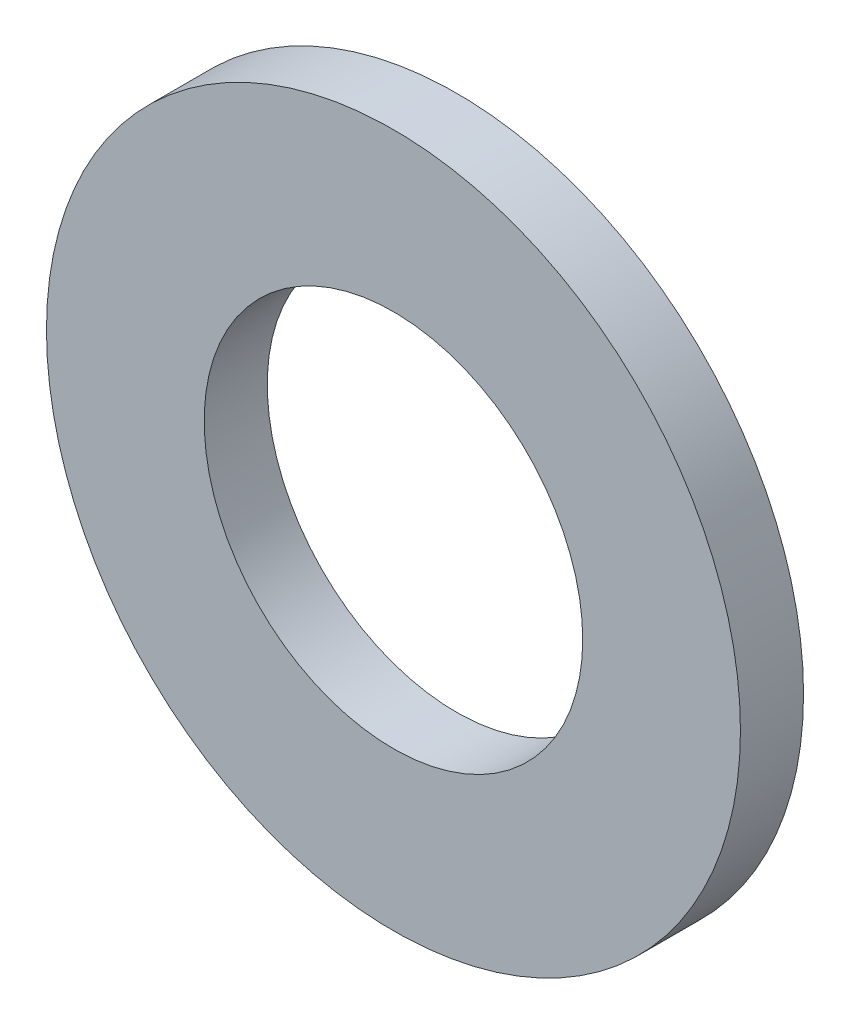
ISO-10303-21;
HEADER;
FILE_DESCRIPTION(('STEP AP214'),'2;1');
FILE_NAME('part.step','',(''),(''),'','','');
FILE_SCHEMA(('AUTOMOTIVE_DESIGN { 1 0 10303 214 1 1 1 1 }'));
ENDSEC;
DATA;
#1=APPLICATION_CONTEXT('core data for automotive mechanical design processes');
#2=APPLICATION_PROTOCOL_DEFINITION('international standard','automotive_design',2000,#1);
#3=PRODUCT_CONTEXT('',#1,'mechanical');
#4=PRODUCT('Part','Part','',(#3));
#5=PRODUCT_RELATED_PRODUCT_CATEGORY('part','',(#4));
#6=PRODUCT_DEFINITION_FORMATION('','',#4);
#7=PRODUCT_DEFINITION_CONTEXT('part definition',#1,'design');
#8=PRODUCT_DEFINITION('design','',#6,#7);
#9=PRODUCT_DEFINITION_SHAPE('','',#8);
#10=(LENGTH_UNIT() NAMED_UNIT(*) SI_UNIT(.MILLI.,.METRE.));
#11=(NAMED_UNIT(*) PLANE_ANGLE_UNIT() SI_UNIT($,.RADIAN.));
#12=(NAMED_UNIT(*) SI_UNIT($,.STERADIAN.) SOLID_ANGLE_UNIT());
#13=UNCERTAINTY_MEASURE_WITH_UNIT(LENGTH_MEASURE(1.E-05),#10,'distance_accuracy_value','');
#14=(GEOMETRIC_REPRESENTATION_CONTEXT(3) GLOBAL_UNCERTAINTY_ASSIGNED_CONTEXT((#13)) GLOBAL_UNIT_ASSIGNED_CONTEXT((#10,
#11,#12)) REPRESENTATION_CONTEXT('',''));
#15=CARTESIAN_POINT('',(0.,0.,0.));
#16=DIRECTION('',(0.,0.,1.));
#17=DIRECTION('',(1.,0.,0.));
#18=AXIS2_PLACEMENT_3D('',#15,#16,#17);
#19=CARTESIAN_POINT('',(0.,0.,1.5875));
#20=DIRECTION('',(0.,0.,1.));
#21=DIRECTION('',(1.,0.,0.));
#22=AXIS2_PLACEMENT_3D('',#19,#20,#21);
#23=PLANE('',#22);
#24=CARTESIAN_POINT('',(0.,0.,1.5875));
#25=DIRECTION('',(0.,0.,1.));
#26=DIRECTION('',(1.,0.,0.));
#27=AXIS2_PLACEMENT_3D('',#24,#25,#26);
#28=CIRCLE('',#27,8.73125);
#29=CARTESIAN_POINT('',(8.73125,0.,1.5875));
#30=VERTEX_POINT('',#29);
#31=EDGE_CURVE('E10',#30,#30,#28,.T.);
#32=ORIENTED_EDGE('',*,*,#31,.T.);
#33=EDGE_LOOP('',(#32));
#34=FACE_BOUND('',#33,.T.);
#35=CARTESIAN_POINT('',(0.,0.,1.5875));
#36=DIRECTION('',(0.,0.,1.));
#37=DIRECTION('',(1.,0.,0.));
#38=AXIS2_PLACEMENT_3D('',#35,#36,#37);
#39=CIRCLE('',#38,4.7625);
#40=CARTESIAN_POINT('',(4.7625,0.,1.5875));
#41=VERTEX_POINT('',#40);
#42=EDGE_CURVE('E54',#41,#41,#39,.T.);
#43=ORIENTED_EDGE('',*,*,#42,.F.);
#44=EDGE_LOOP('',(#43));
#45=FACE_BOUND('',#44,.T.);
#46=ADVANCED_FACE('F41',(#34,#45),#23,.T.);
#47=CARTESIAN_POINT('',(0.,0.,0.));
#48=DIRECTION('',(0.,0.,1.));
#49=DIRECTION('',(1.,0.,0.));
#50=AXIS2_PLACEMENT_3D('',#47,#48,#49);
#51=PLANE('',#50);
#52=CARTESIAN_POINT('',(0.,0.,0.));
#53=DIRECTION('',(0.,0.,1.));
#54=DIRECTION('',(1.,0.,0.));
#55=AXIS2_PLACEMENT_3D('',#52,#53,#54);
#56=CIRCLE('',#55,8.73125);
#57=CARTESIAN_POINT('',(8.73125,0.,0.));
#58=VERTEX_POINT('',#57);
#59=EDGE_CURVE('E45',#58,#58,#56,.T.);
#60=ORIENTED_EDGE('',*,*,#59,.F.);
#61=EDGE_LOOP('',(#60));
#62=FACE_BOUND('',#61,.T.);
#63=CARTESIAN_POINT('',(0.,0.,0.));
#64=DIRECTION('',(0.,0.,1.));
#65=DIRECTION('',(1.,0.,0.));
#66=AXIS2_PLACEMENT_3D('',#63,#64,#65);
#67=CIRCLE('',#66,4.7625);
#68=CARTESIAN_POINT('',(4.7625,0.,0.));
#69=VERTEX_POINT('',#68);
#70=EDGE_CURVE('E56',#69,#69,#67,.T.);
#71=ORIENTED_EDGE('',*,*,#70,.T.);
#72=EDGE_LOOP('',(#71));
#73=FACE_BOUND('',#72,.T.);
#74=ADVANCED_FACE('F68',(#62,#73),#51,.F.);
#75=CARTESIAN_POINT('',(0.,0.,1.5875));
#76=DIRECTION('',(0.,0.,-1.));
#77=DIRECTION('',(-1.,0.,0.));
#78=AXIS2_PLACEMENT_3D('',#75,#76,#77);
#79=CYLINDRICAL_SURFACE('',#78,8.73125);
#80=ORIENTED_EDGE('',*,*,#31,.F.);
#81=EDGE_LOOP('',(#80));
#82=FACE_BOUND('',#81,.T.);
#83=ORIENTED_EDGE('',*,*,#59,.T.);
#84=EDGE_LOOP('',(#83));
#85=FACE_BOUND('',#84,.T.);
#86=ADVANCED_FACE('F43',(#82,#85),#79,.T.);
#87=CARTESIAN_POINT('',(0.,0.,1.5875));
#88=DIRECTION('',(0.,0.,-1.));
#89=DIRECTION('',(-1.,0.,0.));
#90=AXIS2_PLACEMENT_3D('',#87,#88,#89);
#91=CYLINDRICAL_SURFACE('',#90,4.7625);
#92=ORIENTED_EDGE('',*,*,#42,.T.);
#93=EDGE_LOOP('',(#92));
#94=FACE_BOUND('',#93,.T.);
#95=ORIENTED_EDGE('',*,*,#70,.F.);
#96=EDGE_LOOP('',(#95));
#97=FACE_BOUND('',#96,.T.);
#98=ADVANCED_FACE('F64',(#94,#97),#91,.F.);
#99=CLOSED_SHELL('',(#46,#74,#86,#98));
#100=MANIFOLD_SOLID_BREP('B2',#99);
#101=ADVANCED_BREP_SHAPE_REPRESENTATION('',(#18,#100),#14);
#102=SHAPE_DEFINITION_REPRESENTATION(#9,#101);
ENDSEC;
END-ISO-10303-21;
